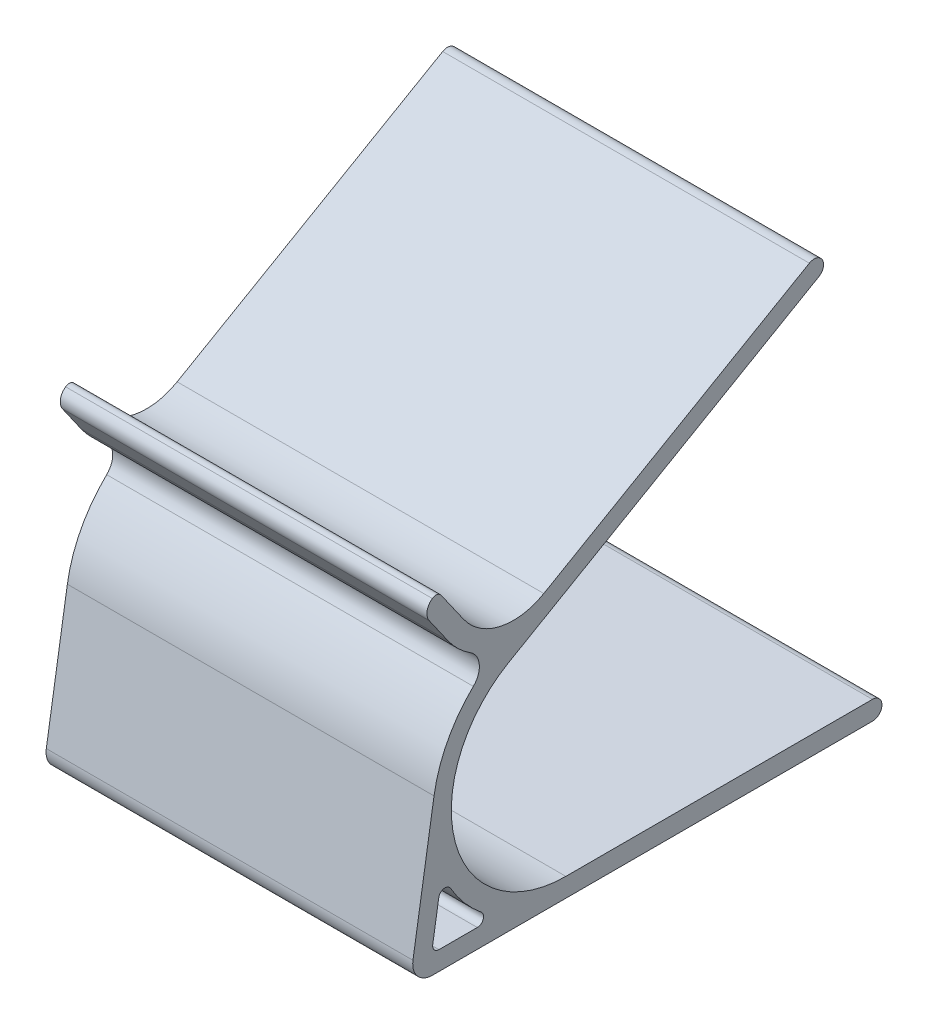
ISO-10303-21;
HEADER;
FILE_DESCRIPTION(('STEP AP214'),'2;1');
FILE_NAME('part.step','',(''),(''),'','','');
FILE_SCHEMA(('AUTOMOTIVE_DESIGN { 1 0 10303 214 1 1 1 1 }'));
ENDSEC;
DATA;
#1=APPLICATION_CONTEXT('core data for automotive mechanical design processes');
#2=APPLICATION_PROTOCOL_DEFINITION('international standard','automotive_design',2000,#1);
#3=PRODUCT_CONTEXT('',#1,'mechanical');
#4=PRODUCT('Part','Part','',(#3));
#5=PRODUCT_RELATED_PRODUCT_CATEGORY('part','',(#4));
#6=PRODUCT_DEFINITION_FORMATION('','',#4);
#7=PRODUCT_DEFINITION_CONTEXT('part definition',#1,'design');
#8=PRODUCT_DEFINITION('design','',#6,#7);
#9=PRODUCT_DEFINITION_SHAPE('','',#8);
#10=(LENGTH_UNIT() NAMED_UNIT(*) SI_UNIT(.MILLI.,.METRE.));
#11=(NAMED_UNIT(*) PLANE_ANGLE_UNIT() SI_UNIT($,.RADIAN.));
#12=(NAMED_UNIT(*) SI_UNIT($,.STERADIAN.) SOLID_ANGLE_UNIT());
#13=UNCERTAINTY_MEASURE_WITH_UNIT(LENGTH_MEASURE(1.E-05),#10,'distance_accuracy_value','');
#14=(GEOMETRIC_REPRESENTATION_CONTEXT(3) GLOBAL_UNCERTAINTY_ASSIGNED_CONTEXT((#13)) GLOBAL_UNIT_ASSIGNED_CONTEXT((#10,
#11,#12)) REPRESENTATION_CONTEXT('',''));
#15=CARTESIAN_POINT('',(0.,0.,0.));
#16=DIRECTION('',(0.,0.,1.));
#17=DIRECTION('',(1.,0.,0.));
#18=AXIS2_PLACEMENT_3D('',#15,#16,#17);
#19=CARTESIAN_POINT('',(58.,21.1173331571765,0.));
#20=DIRECTION('',(-1.,0.,0.));
#21=DIRECTION('',(0.,0.,1.));
#22=AXIS2_PLACEMENT_3D('',#19,#20,#21);
#23=PLANE('',#22);
#24=CARTESIAN_POINT('',(58.,1.5,-48.5));
#25=DIRECTION('',(-1.,0.,0.));
#26=DIRECTION('',(0.,0.,1.));
#27=AXIS2_PLACEMENT_3D('',#24,#25,#26);
#28=CIRCLE('',#27,1.5);
#29=CARTESIAN_POINT('',(58.,0.,-48.5));
#30=VERTEX_POINT('',#29);
#31=CARTESIAN_POINT('',(58.,1.5,-50.));
#32=VERTEX_POINT('',#31);
#33=EDGE_CURVE('E449',#30,#32,#28,.F.);
#34=ORIENTED_EDGE('',*,*,#33,.T.);
#35=CARTESIAN_POINT('',(58.,1.5,-48.5));
#36=DIRECTION('',(-1.,0.,0.));
#37=DIRECTION('',(0.,0.,1.));
#38=AXIS2_PLACEMENT_3D('',#35,#36,#37);
#39=CIRCLE('',#38,1.5);
#40=CARTESIAN_POINT('',(58.,3.,-48.5));
#41=VERTEX_POINT('',#40);
#42=EDGE_CURVE('E452',#32,#41,#39,.F.);
#43=ORIENTED_EDGE('',*,*,#42,.T.);
#44=DIRECTION('',(0.,0.,1.));
#45=VECTOR('',#44,1.);
#46=CARTESIAN_POINT('',(58.,3.,-50.));
#47=LINE('',#46,#45);
#48=CARTESIAN_POINT('',(58.,2.99999999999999,0.));
#49=VERTEX_POINT('',#48);
#50=EDGE_CURVE('E286',#41,#49,#47,.T.);
#51=ORIENTED_EDGE('',*,*,#50,.T.);
#52=CARTESIAN_POINT('',(58.,21.1173331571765,0.));
#53=DIRECTION('',(-1.,0.,0.));
#54=DIRECTION('',(0.,0.,1.));
#55=AXIS2_PLACEMENT_3D('',#52,#53,#54);
#56=CIRCLE('',#55,18.1173331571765);
#57=CARTESIAN_POINT('',(58.,36.8074039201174,9.05866657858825));
#58=VERTEX_POINT('',#57);
#59=EDGE_CURVE('E290',#49,#58,#56,.T.);
#60=ORIENTED_EDGE('',*,*,#59,.T.);
#61=DIRECTION('',(0.,0.500000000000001,-0.866025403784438));
#62=VECTOR('',#61,1.);
#63=CARTESIAN_POINT('',(58.,65.8917429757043,-41.3168863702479));
#64=LINE('',#63,#62);
#65=CARTESIAN_POINT('',(58.,65.1417429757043,-40.0178482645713));
#66=VERTEX_POINT('',#65);
#67=EDGE_CURVE('E293',#58,#66,#64,.T.);
#68=ORIENTED_EDGE('',*,*,#67,.T.);
#69=CARTESIAN_POINT('',(58.,66.4407810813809,-39.2678482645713));
#70=DIRECTION('',(-1.,0.,0.));
#71=DIRECTION('',(0.,0.,1.));
#72=AXIS2_PLACEMENT_3D('',#69,#70,#71);
#73=CIRCLE('',#72,1.5);
#74=CARTESIAN_POINT('',(58.,67.1907810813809,-40.5668863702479));
#75=VERTEX_POINT('',#74);
#76=EDGE_CURVE('E62',#66,#75,#73,.F.);
#77=ORIENTED_EDGE('',*,*,#76,.T.);
#78=CARTESIAN_POINT('',(58.,66.4407810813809,-39.2678482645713));
#79=DIRECTION('',(-1.,0.,0.));
#80=DIRECTION('',(0.,0.,1.));
#81=AXIS2_PLACEMENT_3D('',#78,#79,#80);
#82=CIRCLE('',#81,1.5);
#83=CARTESIAN_POINT('',(58.,67.7398191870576,-38.5178482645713));
#84=VERTEX_POINT('',#83);
#85=EDGE_CURVE('E57',#75,#84,#82,.F.);
#86=ORIENTED_EDGE('',*,*,#85,.T.);
#87=DIRECTION('',(0.,-0.5,0.866025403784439));
#88=VECTOR('',#87,1.);
#89=CARTESIAN_POINT('',(58.,68.4898191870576,-39.8168863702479));
#90=LINE('',#89,#88);
#91=CARTESIAN_POINT('',(58.,43.4898191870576,3.484383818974));
#92=VERTEX_POINT('',#91);
#93=EDGE_CURVE('E296',#84,#92,#90,.T.);
#94=ORIENTED_EDGE('',*,*,#93,.T.);
#95=CARTESIAN_POINT('',(58.,51.8220375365,8.29499232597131));
#96=DIRECTION('',(-1.,0.,0.));
#97=DIRECTION('',(0.,0.,1.));
#98=AXIS2_PLACEMENT_3D('',#95,#96,#97);
#99=CIRCLE('',#98,9.62121701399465);
#100=CARTESIAN_POINT('',(58.,46.303534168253,16.1762319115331));
#101=VERTEX_POINT('',#100);
#102=EDGE_CURVE('E299',#92,#101,#99,.T.);
#103=ORIENTED_EDGE('',*,*,#102,.T.);
#104=DIRECTION('',(0.,0.819152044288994,0.573576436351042));
#105=VECTOR('',#104,1.);
#106=CARTESIAN_POINT('',(58.,46.303534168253,16.1762319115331));
#107=LINE('',#106,#105);
#108=CARTESIAN_POINT('',(58.,51.3822768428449,19.7324058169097));
#109=VERTEX_POINT('',#108);
#110=EDGE_CURVE('E302',#101,#109,#107,.T.);
#111=ORIENTED_EDGE('',*,*,#110,.T.);
#112=CARTESIAN_POINT('',(58.,50.8087004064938,20.5515578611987));
#113=DIRECTION('',(-1.,0.,0.));
#114=DIRECTION('',(0.,0.,1.));
#115=AXIS2_PLACEMENT_3D('',#112,#113,#114);
#116=CIRCLE('',#115,1.);
#117=CARTESIAN_POINT('',(58.,51.6278524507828,21.1251342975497));
#118=VERTEX_POINT('',#117);
#119=EDGE_CURVE('E426',#109,#118,#116,.F.);
#120=ORIENTED_EDGE('',*,*,#119,.T.);
#121=CARTESIAN_POINT('',(58.,49.9895483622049,19.9779814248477));
#122=DIRECTION('',(-1.,0.,0.));
#123=DIRECTION('',(0.,0.,1.));
#124=AXIS2_PLACEMENT_3D('',#121,#122,#123);
#125=CIRCLE('',#124,2.);
#126=CARTESIAN_POINT('',(58.,48.8423954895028,21.6162855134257));
#127=VERTEX_POINT('',#126);
#128=EDGE_CURVE('E417',#118,#127,#125,.F.);
#129=ORIENTED_EDGE('',*,*,#128,.T.);
#130=DIRECTION('',(0.,-0.819152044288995,-0.573576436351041));
#131=VECTOR('',#130,1.);
#132=CARTESIAN_POINT('',(58.,50.4806995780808,22.7634383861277));
#133=LINE('',#132,#131);
#134=CARTESIAN_POINT('',(58.,44.5828048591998,18.6336880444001));
#135=VERTEX_POINT('',#134);
#136=EDGE_CURVE('E306',#127,#135,#133,.T.);
#137=ORIENTED_EDGE('',*,*,#136,.T.);
#138=CARTESIAN_POINT('',(58.,51.8220375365,8.29499232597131));
#139=DIRECTION('',(1.,0.,0.));
#140=DIRECTION('',(0.,0.,-1.));
#141=AXIS2_PLACEMENT_3D('',#138,#139,#140);
#142=CIRCLE('',#141,12.6212170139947);
#143=CARTESIAN_POINT('',(58.,41.1971133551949,15.1071949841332));
#144=VERTEX_POINT('',#143);
#145=EDGE_CURVE('E309',#135,#144,#142,.T.);
#146=ORIENTED_EDGE('',*,*,#145,.T.);
#147=CARTESIAN_POINT('',(58.,38.5831118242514,16.7831700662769));
#148=DIRECTION('',(-1.,0.,0.));
#149=DIRECTION('',(0.,0.,1.));
#150=AXIS2_PLACEMENT_3D('',#147,#148,#149);
#151=CIRCLE('',#150,3.10514033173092);
#152=CARTESIAN_POINT('',(58.,36.3441293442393,14.6316929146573));
#153=VERTEX_POINT('',#152);
#154=EDGE_CURVE('E312',#144,#153,#151,.T.);
#155=ORIENTED_EDGE('',*,*,#154,.T.);
#156=CARTESIAN_POINT('',(58.,21.1173331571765,0.));
#157=DIRECTION('',(1.,0.,0.));
#158=DIRECTION('',(0.,0.,1.));
#159=AXIS2_PLACEMENT_3D('',#156,#157,#158);
#160=CIRCLE('',#159,21.1173331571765);
#161=CARTESIAN_POINT('',(58.,24.4479096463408,20.8530338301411));
#162=VERTEX_POINT('',#161);
#163=EDGE_CURVE('E315',#153,#162,#160,.T.);
#164=ORIENTED_EDGE('',*,*,#163,.T.);
#165=DIRECTION('',(0.,-0.987484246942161,0.157717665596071));
#166=VECTOR('',#165,1.);
#167=CARTESIAN_POINT('',(58.,3.59487581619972,24.1836103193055));
#168=LINE('',#167,#166);
#169=CARTESIAN_POINT('',(58.,3.59487581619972,24.1836103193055));
#170=VERTEX_POINT('',#169);
#171=EDGE_CURVE('E318',#162,#170,#168,.T.);
#172=ORIENTED_EDGE('',*,*,#171,.T.);
#173=CARTESIAN_POINT('',(58.,3.10514033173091,21.1173331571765));
#174=DIRECTION('',(1.,0.,0.));
#175=DIRECTION('',(0.,0.,1.));
#176=AXIS2_PLACEMENT_3D('',#173,#174,#175);
#177=CIRCLE('',#176,3.10514033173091);
#178=CARTESIAN_POINT('',(58.,0.,21.1173331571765));
#179=VERTEX_POINT('',#178);
#180=EDGE_CURVE('E321',#170,#179,#177,.T.);
#181=ORIENTED_EDGE('',*,*,#180,.T.);
#182=DIRECTION('',(0.,0.,-1.));
#183=VECTOR('',#182,1.);
#184=CARTESIAN_POINT('',(58.,0.,21.1173331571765));
#185=LINE('',#184,#183);
#186=EDGE_CURVE('E282',#179,#30,#185,.T.);
#187=ORIENTED_EDGE('',*,*,#186,.T.);
#188=EDGE_LOOP('',(#34,#43,#51,#60,#68,#77,#86,#94,#103,#111,#120,#129,#137,#146,#155,#164,#172,
#181,#187));
#189=FACE_BOUND('',#188,.T.);
#190=CARTESIAN_POINT('',(58.,4.,20.068207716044));
#191=DIRECTION('',(1.,0.,0.));
#192=DIRECTION('',(0.,0.,-1.));
#193=AXIS2_PLACEMENT_3D('',#190,#191,#192);
#194=CIRCLE('',#193,1.);
#195=CARTESIAN_POINT('',(58.,4.15771766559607,21.0556919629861));
#196=VERTEX_POINT('',#195);
#197=CARTESIAN_POINT('',(58.,3.,20.068207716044));
#198=VERTEX_POINT('',#197);
#199=EDGE_CURVE('E207',#196,#198,#194,.T.);
#200=ORIENTED_EDGE('',*,*,#199,.F.);
#201=DIRECTION('',(0.,-0.987484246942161,0.15771766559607));
#202=VECTOR('',#201,1.);
#203=CARTESIAN_POINT('',(58.,10.1438656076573,20.0996045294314));
#204=LINE('',#203,#202);
#205=CARTESIAN_POINT('',(58.,10.1438656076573,20.0996045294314));
#206=VERTEX_POINT('',#205);
#207=EDGE_CURVE('E245',#206,#196,#204,.T.);
#208=ORIENTED_EDGE('',*,*,#207,.F.);
#209=CARTESIAN_POINT('',(58.,9.98614794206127,19.1121202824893));
#210=DIRECTION('',(1.,0.,0.));
#211=DIRECTION('',(0.,0.,1.));
#212=AXIS2_PLACEMENT_3D('',#209,#210,#211);
#213=CIRCLE('',#212,1.);
#214=CARTESIAN_POINT('',(58.,10.4894267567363,18.247996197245));
#215=VERTEX_POINT('',#214);
#216=EDGE_CURVE('E241',#215,#206,#213,.T.);
#217=ORIENTED_EDGE('',*,*,#216,.F.);
#218=CARTESIAN_POINT('',(58.,21.1173331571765,0.));
#219=DIRECTION('',(-1.,0.,0.));
#220=DIRECTION('',(0.,0.,-1.));
#221=AXIS2_PLACEMENT_3D('',#218,#219,#220);
#222=CIRCLE('',#221,21.1173331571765);
#223=CARTESIAN_POINT('',(58.,4.77393296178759,13.3729215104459));
#224=VERTEX_POINT('',#223);
#225=EDGE_CURVE('E236',#224,#215,#222,.T.);
#226=ORIENTED_EDGE('',*,*,#225,.F.);
#227=CARTESIAN_POINT('',(58.,4.,14.0061890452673));
#228=DIRECTION('',(1.,0.,0.));
#229=DIRECTION('',(0.,0.,1.));
#230=AXIS2_PLACEMENT_3D('',#227,#228,#229);
#231=CIRCLE('',#230,1.);
#232=CARTESIAN_POINT('',(58.,3.,14.0061890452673));
#233=VERTEX_POINT('',#232);
#234=EDGE_CURVE('E232',#233,#224,#231,.T.);
#235=ORIENTED_EDGE('',*,*,#234,.F.);
#236=DIRECTION('',(0.,0.,-1.));
#237=VECTOR('',#236,1.);
#238=CARTESIAN_POINT('',(58.,3.,20.068207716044));
#239=LINE('',#238,#237);
#240=EDGE_CURVE('E218',#198,#233,#239,.T.);
#241=ORIENTED_EDGE('',*,*,#240,.F.);
#242=EDGE_LOOP('',(#200,#208,#217,#226,#235,#241));
#243=FACE_BOUND('',#242,.T.);
#244=ADVANCED_FACE('F39',(#189,#243),#23,.F.);
#245=CARTESIAN_POINT('',(0.,21.1173331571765,0.));
#246=DIRECTION('',(-1.,0.,0.));
#247=DIRECTION('',(0.,0.,1.));
#248=AXIS2_PLACEMENT_3D('',#245,#246,#247);
#249=PLANE('',#248);
#250=DIRECTION('',(0.,0.,1.));
#251=VECTOR('',#250,1.);
#252=CARTESIAN_POINT('',(0.,3.,-50.));
#253=LINE('',#252,#251);
#254=CARTESIAN_POINT('',(0.,3.,-48.5));
#255=VERTEX_POINT('',#254);
#256=CARTESIAN_POINT('',(0.,2.99999999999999,0.));
#257=VERTEX_POINT('',#256);
#258=EDGE_CURVE('E328',#255,#257,#253,.T.);
#259=ORIENTED_EDGE('',*,*,#258,.F.);
#260=CARTESIAN_POINT('',(0.,1.5,-48.5));
#261=DIRECTION('',(-1.,0.,0.));
#262=DIRECTION('',(0.,0.,1.));
#263=AXIS2_PLACEMENT_3D('',#260,#261,#262);
#264=CIRCLE('',#263,1.5);
#265=CARTESIAN_POINT('',(0.,1.5,-50.));
#266=VERTEX_POINT('',#265);
#267=EDGE_CURVE('E442',#255,#266,#264,.T.);
#268=ORIENTED_EDGE('',*,*,#267,.T.);
#269=CARTESIAN_POINT('',(0.,1.5,-48.5));
#270=DIRECTION('',(-1.,0.,0.));
#271=DIRECTION('',(0.,0.,1.));
#272=AXIS2_PLACEMENT_3D('',#269,#270,#271);
#273=CIRCLE('',#272,1.5);
#274=CARTESIAN_POINT('',(0.,0.,-48.5));
#275=VERTEX_POINT('',#274);
#276=EDGE_CURVE('E439',#266,#275,#273,.T.);
#277=ORIENTED_EDGE('',*,*,#276,.T.);
#278=DIRECTION('',(0.,0.,-1.));
#279=VECTOR('',#278,1.);
#280=CARTESIAN_POINT('',(0.,0.,0.));
#281=LINE('',#280,#279);
#282=CARTESIAN_POINT('',(0.,0.,21.1173331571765));
#283=VERTEX_POINT('',#282);
#284=EDGE_CURVE('E227',#283,#275,#281,.T.);
#285=ORIENTED_EDGE('',*,*,#284,.F.);
#286=CARTESIAN_POINT('',(0.,3.10514033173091,21.1173331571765));
#287=DIRECTION('',(1.,0.,0.));
#288=DIRECTION('',(0.,0.,1.));
#289=AXIS2_PLACEMENT_3D('',#286,#287,#288);
#290=CIRCLE('',#289,3.10514033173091);
#291=CARTESIAN_POINT('',(0.,3.59487581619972,24.1836103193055));
#292=VERTEX_POINT('',#291);
#293=EDGE_CURVE('E287',#292,#283,#290,.T.);
#294=ORIENTED_EDGE('',*,*,#293,.F.);
#295=DIRECTION('',(0.,-0.987484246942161,0.157717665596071));
#296=VECTOR('',#295,1.);
#297=CARTESIAN_POINT('',(0.,3.59487581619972,24.1836103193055));
#298=LINE('',#297,#296);
#299=CARTESIAN_POINT('',(0.,24.4479096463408,20.8530338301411));
#300=VERTEX_POINT('',#299);
#301=EDGE_CURVE('E360',#300,#292,#298,.T.);
#302=ORIENTED_EDGE('',*,*,#301,.F.);
#303=CARTESIAN_POINT('',(0.,21.1173331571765,0.));
#304=DIRECTION('',(1.,0.,0.));
#305=DIRECTION('',(0.,0.,1.));
#306=AXIS2_PLACEMENT_3D('',#303,#304,#305);
#307=CIRCLE('',#306,21.1173331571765);
#308=CARTESIAN_POINT('',(0.,36.3441293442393,14.6316929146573));
#309=VERTEX_POINT('',#308);
#310=EDGE_CURVE('E357',#309,#300,#307,.T.);
#311=ORIENTED_EDGE('',*,*,#310,.F.);
#312=CARTESIAN_POINT('',(0.,38.5831118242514,16.7831700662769));
#313=DIRECTION('',(-1.,0.,0.));
#314=DIRECTION('',(0.,0.,1.));
#315=AXIS2_PLACEMENT_3D('',#312,#313,#314);
#316=CIRCLE('',#315,3.10514033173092);
#317=CARTESIAN_POINT('',(0.,41.1971133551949,15.1071949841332));
#318=VERTEX_POINT('',#317);
#319=EDGE_CURVE('E354',#318,#309,#316,.T.);
#320=ORIENTED_EDGE('',*,*,#319,.F.);
#321=CARTESIAN_POINT('',(0.,51.8220375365,8.29499232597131));
#322=DIRECTION('',(1.,0.,0.));
#323=DIRECTION('',(0.,0.,-1.));
#324=AXIS2_PLACEMENT_3D('',#321,#322,#323);
#325=CIRCLE('',#324,12.6212170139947);
#326=CARTESIAN_POINT('',(0.,44.5828048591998,18.6336880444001));
#327=VERTEX_POINT('',#326);
#328=EDGE_CURVE('E351',#327,#318,#325,.T.);
#329=ORIENTED_EDGE('',*,*,#328,.F.);
#330=DIRECTION('',(0.,-0.819152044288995,-0.573576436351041));
#331=VECTOR('',#330,1.);
#332=CARTESIAN_POINT('',(0.,50.4806995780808,22.7634383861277));
#333=LINE('',#332,#331);
#334=CARTESIAN_POINT('',(0.,48.8423954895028,21.6162855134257));
#335=VERTEX_POINT('',#334);
#336=EDGE_CURVE('E348',#335,#327,#333,.T.);
#337=ORIENTED_EDGE('',*,*,#336,.F.);
#338=CARTESIAN_POINT('',(0.,49.9895483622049,19.9779814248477));
#339=DIRECTION('',(-1.,0.,0.));
#340=DIRECTION('',(0.,0.,1.));
#341=AXIS2_PLACEMENT_3D('',#338,#339,#340);
#342=CIRCLE('',#341,2.);
#343=CARTESIAN_POINT('',(0.,51.6278524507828,21.1251342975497));
#344=VERTEX_POINT('',#343);
#345=EDGE_CURVE('E409',#335,#344,#342,.T.);
#346=ORIENTED_EDGE('',*,*,#345,.T.);
#347=CARTESIAN_POINT('',(0.,50.8087004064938,20.5515578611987));
#348=DIRECTION('',(-1.,0.,0.));
#349=DIRECTION('',(0.,0.,1.));
#350=AXIS2_PLACEMENT_3D('',#347,#348,#349);
#351=CIRCLE('',#350,1.);
#352=CARTESIAN_POINT('',(0.,51.3822768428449,19.7324058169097));
#353=VERTEX_POINT('',#352);
#354=EDGE_CURVE('E420',#344,#353,#351,.T.);
#355=ORIENTED_EDGE('',*,*,#354,.T.);
#356=DIRECTION('',(0.,0.819152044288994,0.573576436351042));
#357=VECTOR('',#356,1.);
#358=CARTESIAN_POINT('',(0.,46.303534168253,16.1762319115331));
#359=LINE('',#358,#357);
#360=CARTESIAN_POINT('',(0.,46.303534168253,16.1762319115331));
#361=VERTEX_POINT('',#360);
#362=EDGE_CURVE('E344',#361,#353,#359,.T.);
#363=ORIENTED_EDGE('',*,*,#362,.F.);
#364=CARTESIAN_POINT('',(0.,51.8220375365,8.29499232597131));
#365=DIRECTION('',(-1.,0.,0.));
#366=DIRECTION('',(0.,0.,1.));
#367=AXIS2_PLACEMENT_3D('',#364,#365,#366);
#368=CIRCLE('',#367,9.62121701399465);
#369=CARTESIAN_POINT('',(0.,43.4898191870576,3.484383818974));
#370=VERTEX_POINT('',#369);
#371=EDGE_CURVE('E341',#370,#361,#368,.T.);
#372=ORIENTED_EDGE('',*,*,#371,.F.);
#373=DIRECTION('',(0.,-0.5,0.866025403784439));
#374=VECTOR('',#373,1.);
#375=CARTESIAN_POINT('',(0.,68.4898191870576,-39.8168863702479));
#376=LINE('',#375,#374);
#377=CARTESIAN_POINT('',(0.,67.7398191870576,-38.5178482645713));
#378=VERTEX_POINT('',#377);
#379=EDGE_CURVE('E338',#378,#370,#376,.T.);
#380=ORIENTED_EDGE('',*,*,#379,.F.);
#381=CARTESIAN_POINT('',(0.,66.4407810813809,-39.2678482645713));
#382=DIRECTION('',(-1.,0.,0.));
#383=DIRECTION('',(0.,0.,1.));
#384=AXIS2_PLACEMENT_3D('',#381,#382,#383);
#385=CIRCLE('',#384,1.5);
#386=CARTESIAN_POINT('',(0.,67.1907810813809,-40.5668863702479));
#387=VERTEX_POINT('',#386);
#388=EDGE_CURVE('E433',#378,#387,#385,.T.);
#389=ORIENTED_EDGE('',*,*,#388,.T.);
#390=CARTESIAN_POINT('',(0.,66.4407810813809,-39.2678482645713));
#391=DIRECTION('',(-1.,0.,0.));
#392=DIRECTION('',(0.,0.,1.));
#393=AXIS2_PLACEMENT_3D('',#390,#391,#392);
#394=CIRCLE('',#393,1.5);
#395=CARTESIAN_POINT('',(0.,65.1417429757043,-40.0178482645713));
#396=VERTEX_POINT('',#395);
#397=EDGE_CURVE('E436',#387,#396,#394,.T.);
#398=ORIENTED_EDGE('',*,*,#397,.T.);
#399=DIRECTION('',(0.,0.500000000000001,-0.866025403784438));
#400=VECTOR('',#399,1.);
#401=CARTESIAN_POINT('',(0.,65.8917429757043,-41.3168863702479));
#402=LINE('',#401,#400);
#403=CARTESIAN_POINT('',(0.,36.8074039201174,9.05866657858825));
#404=VERTEX_POINT('',#403);
#405=EDGE_CURVE('E334',#404,#396,#402,.T.);
#406=ORIENTED_EDGE('',*,*,#405,.F.);
#407=CARTESIAN_POINT('',(0.,21.1173331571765,0.));
#408=DIRECTION('',(-1.,0.,0.));
#409=DIRECTION('',(0.,0.,1.));
#410=AXIS2_PLACEMENT_3D('',#407,#408,#409);
#411=CIRCLE('',#410,18.1173331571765);
#412=EDGE_CURVE('E331',#257,#404,#411,.T.);
#413=ORIENTED_EDGE('',*,*,#412,.F.);
#414=EDGE_LOOP('',(#259,#268,#277,#285,#294,#302,#311,#320,#329,#337,#346,#355,#363,#372,#380,
#389,#398,#406,#413));
#415=FACE_BOUND('',#414,.T.);
#416=DIRECTION('',(0.,-0.987484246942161,0.15771766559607));
#417=VECTOR('',#416,1.);
#418=CARTESIAN_POINT('',(0.,10.1438656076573,20.0996045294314));
#419=LINE('',#418,#417);
#420=CARTESIAN_POINT('',(0.,10.1438656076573,20.0996045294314));
#421=VERTEX_POINT('',#420);
#422=CARTESIAN_POINT('',(0.,4.15771766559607,21.0556919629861));
#423=VERTEX_POINT('',#422);
#424=EDGE_CURVE('E219',#421,#423,#419,.T.);
#425=ORIENTED_EDGE('',*,*,#424,.T.);
#426=CARTESIAN_POINT('',(0.,4.,20.068207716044));
#427=DIRECTION('',(1.,0.,0.));
#428=DIRECTION('',(0.,0.,-1.));
#429=AXIS2_PLACEMENT_3D('',#426,#427,#428);
#430=CIRCLE('',#429,1.);
#431=CARTESIAN_POINT('',(0.,3.,20.068207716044));
#432=VERTEX_POINT('',#431);
#433=EDGE_CURVE('E248',#423,#432,#430,.T.);
#434=ORIENTED_EDGE('',*,*,#433,.T.);
#435=DIRECTION('',(0.,0.,-1.));
#436=VECTOR('',#435,1.);
#437=CARTESIAN_POINT('',(0.,3.,20.068207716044));
#438=LINE('',#437,#436);
#439=CARTESIAN_POINT('',(0.,3.,14.0061890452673));
#440=VERTEX_POINT('',#439);
#441=EDGE_CURVE('E225',#432,#440,#438,.T.);
#442=ORIENTED_EDGE('',*,*,#441,.T.);
#443=CARTESIAN_POINT('',(0.,4.,14.0061890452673));
#444=DIRECTION('',(1.,0.,0.));
#445=DIRECTION('',(0.,0.,1.));
#446=AXIS2_PLACEMENT_3D('',#443,#444,#445);
#447=CIRCLE('',#446,1.);
#448=CARTESIAN_POINT('',(0.,4.77393296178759,13.3729215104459));
#449=VERTEX_POINT('',#448);
#450=EDGE_CURVE('E254',#440,#449,#447,.T.);
#451=ORIENTED_EDGE('',*,*,#450,.T.);
#452=CARTESIAN_POINT('',(0.,21.1173331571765,0.));
#453=DIRECTION('',(-1.,0.,0.));
#454=DIRECTION('',(0.,0.,-1.));
#455=AXIS2_PLACEMENT_3D('',#452,#453,#454);
#456=CIRCLE('',#455,21.1173331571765);
#457=CARTESIAN_POINT('',(0.,10.4894267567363,18.247996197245));
#458=VERTEX_POINT('',#457);
#459=EDGE_CURVE('E258',#449,#458,#456,.T.);
#460=ORIENTED_EDGE('',*,*,#459,.T.);
#461=CARTESIAN_POINT('',(0.,9.98614794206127,19.1121202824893));
#462=DIRECTION('',(1.,0.,0.));
#463=DIRECTION('',(0.,0.,1.));
#464=AXIS2_PLACEMENT_3D('',#461,#462,#463);
#465=CIRCLE('',#464,1.);
#466=EDGE_CURVE('E262',#458,#421,#465,.T.);
#467=ORIENTED_EDGE('',*,*,#466,.T.);
#468=EDGE_LOOP('',(#425,#434,#442,#451,#460,#467));
#469=FACE_BOUND('',#468,.T.);
#470=ADVANCED_FACE('F482',(#415,#469),#249,.T.);
#471=CARTESIAN_POINT('',(58.,0.,0.));
#472=DIRECTION('',(0.,1.,0.));
#473=DIRECTION('',(0.,0.,1.));
#474=AXIS2_PLACEMENT_3D('',#471,#472,#473);
#475=PLANE('',#474);
#476=ORIENTED_EDGE('',*,*,#284,.T.);
#477=DIRECTION('',(-1.,0.,0.));
#478=VECTOR('',#477,1.);
#479=CARTESIAN_POINT('',(58.,0.,-48.5));
#480=LINE('',#479,#478);
#481=EDGE_CURVE('E455',#275,#30,#480,.F.);
#482=ORIENTED_EDGE('',*,*,#481,.T.);
#483=ORIENTED_EDGE('',*,*,#186,.F.);
#484=DIRECTION('',(-1.,0.,0.));
#485=VECTOR('',#484,1.);
#486=CARTESIAN_POINT('',(58.,0.,21.1173331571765));
#487=LINE('',#486,#485);
#488=EDGE_CURVE('E324',#179,#283,#487,.T.);
#489=ORIENTED_EDGE('',*,*,#488,.T.);
#490=EDGE_LOOP('',(#476,#482,#483,#489));
#491=FACE_BOUND('',#490,.T.);
#492=ADVANCED_FACE('F534',(#491),#475,.F.);
#493=CARTESIAN_POINT('',(58.,3.,-50.));
#494=DIRECTION('',(0.,-1.,0.));
#495=DIRECTION('',(0.,0.,-1.));
#496=AXIS2_PLACEMENT_3D('',#493,#494,#495);
#497=PLANE('',#496);
#498=ORIENTED_EDGE('',*,*,#50,.F.);
#499=DIRECTION('',(-1.,0.,0.));
#500=VECTOR('',#499,1.);
#501=CARTESIAN_POINT('',(58.,3.,-48.5));
#502=LINE('',#501,#500);
#503=EDGE_CURVE('E429',#41,#255,#502,.T.);
#504=ORIENTED_EDGE('',*,*,#503,.T.);
#505=ORIENTED_EDGE('',*,*,#258,.T.);
#506=DIRECTION('',(-1.,0.,0.));
#507=VECTOR('',#506,1.);
#508=CARTESIAN_POINT('',(58.,2.99999999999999,0.));
#509=LINE('',#508,#507);
#510=EDGE_CURVE('E401',#49,#257,#509,.T.);
#511=ORIENTED_EDGE('',*,*,#510,.F.);
#512=EDGE_LOOP('',(#498,#504,#505,#511));
#513=FACE_BOUND('',#512,.T.);
#514=ADVANCED_FACE('F543',(#513),#497,.F.);
#515=CARTESIAN_POINT('',(58.,21.1173331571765,0.));
#516=DIRECTION('',(-1.,0.,0.));
#517=DIRECTION('',(0.,0.,1.));
#518=AXIS2_PLACEMENT_3D('',#515,#516,#517);
#519=CYLINDRICAL_SURFACE('',#518,18.1173331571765);
#520=ORIENTED_EDGE('',*,*,#412,.T.);
#521=DIRECTION('',(-1.,0.,0.));
#522=VECTOR('',#521,1.);
#523=CARTESIAN_POINT('',(58.,36.8074039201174,9.05866657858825));
#524=LINE('',#523,#522);
#525=EDGE_CURVE('E397',#58,#404,#524,.T.);
#526=ORIENTED_EDGE('',*,*,#525,.F.);
#527=ORIENTED_EDGE('',*,*,#59,.F.);
#528=ORIENTED_EDGE('',*,*,#510,.T.);
#529=EDGE_LOOP('',(#520,#526,#527,#528));
#530=FACE_BOUND('',#529,.T.);
#531=ADVANCED_FACE('F549',(#530),#519,.F.);
#532=CARTESIAN_POINT('',(58.,65.8917429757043,-41.3168863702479));
#533=DIRECTION('',(0.,0.866025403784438,0.500000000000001));
#534=DIRECTION('',(0.,-0.500000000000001,0.866025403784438));
#535=AXIS2_PLACEMENT_3D('',#532,#533,#534);
#536=PLANE('',#535);
#537=ORIENTED_EDGE('',*,*,#405,.T.);
#538=DIRECTION('',(-1.,0.,0.));
#539=VECTOR('',#538,1.);
#540=CARTESIAN_POINT('',(58.,65.1417429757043,-40.0178482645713));
#541=LINE('',#540,#539);
#542=EDGE_CURVE('E49',#396,#66,#541,.F.);
#543=ORIENTED_EDGE('',*,*,#542,.T.);
#544=ORIENTED_EDGE('',*,*,#67,.F.);
#545=ORIENTED_EDGE('',*,*,#525,.T.);
#546=EDGE_LOOP('',(#537,#543,#544,#545));
#547=FACE_BOUND('',#546,.T.);
#548=ADVANCED_FACE('F553',(#547),#536,.F.);
#549=CARTESIAN_POINT('',(58.,68.4898191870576,-39.8168863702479));
#550=DIRECTION('',(0.,-0.866025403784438,-0.5));
#551=DIRECTION('',(0.,0.5,-0.866025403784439));
#552=AXIS2_PLACEMENT_3D('',#549,#550,#551);
#553=PLANE('',#552);
#554=ORIENTED_EDGE('',*,*,#93,.F.);
#555=DIRECTION('',(-1.,0.,0.));
#556=VECTOR('',#555,1.);
#557=CARTESIAN_POINT('',(58.,67.7398191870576,-38.5178482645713));
#558=LINE('',#557,#556);
#559=EDGE_CURVE('E11',#84,#378,#558,.T.);
#560=ORIENTED_EDGE('',*,*,#559,.T.);
#561=ORIENTED_EDGE('',*,*,#379,.T.);
#562=DIRECTION('',(-1.,0.,0.));
#563=VECTOR('',#562,1.);
#564=CARTESIAN_POINT('',(58.,43.4898191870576,3.484383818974));
#565=LINE('',#564,#563);
#566=EDGE_CURVE('E393',#92,#370,#565,.T.);
#567=ORIENTED_EDGE('',*,*,#566,.F.);
#568=EDGE_LOOP('',(#554,#560,#561,#567));
#569=FACE_BOUND('',#568,.T.);
#570=ADVANCED_FACE('F477',(#569),#553,.F.);
#571=CARTESIAN_POINT('',(58.,51.8220375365,8.29499232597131));
#572=DIRECTION('',(-1.,0.,0.));
#573=DIRECTION('',(0.,0.,1.));
#574=AXIS2_PLACEMENT_3D('',#571,#572,#573);
#575=CYLINDRICAL_SURFACE('',#574,9.62121701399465);
#576=ORIENTED_EDGE('',*,*,#371,.T.);
#577=DIRECTION('',(-1.,0.,0.));
#578=VECTOR('',#577,1.);
#579=CARTESIAN_POINT('',(58.,46.303534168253,16.1762319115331));
#580=LINE('',#579,#578);
#581=EDGE_CURVE('E389',#101,#361,#580,.T.);
#582=ORIENTED_EDGE('',*,*,#581,.F.);
#583=ORIENTED_EDGE('',*,*,#102,.F.);
#584=ORIENTED_EDGE('',*,*,#566,.T.);
#585=EDGE_LOOP('',(#576,#582,#583,#584));
#586=FACE_BOUND('',#585,.T.);
#587=ADVANCED_FACE('F487',(#586),#575,.F.);
#588=CARTESIAN_POINT('',(58.,46.303534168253,16.1762319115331));
#589=DIRECTION('',(0.,-0.573576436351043,0.819152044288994));
#590=DIRECTION('',(0.,-0.819152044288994,-0.573576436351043));
#591=AXIS2_PLACEMENT_3D('',#588,#589,#590);
#592=PLANE('',#591);
#593=ORIENTED_EDGE('',*,*,#362,.T.);
#594=DIRECTION('',(-1.,0.,0.));
#595=VECTOR('',#594,1.);
#596=CARTESIAN_POINT('',(58.,51.3822768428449,19.7324058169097));
#597=LINE('',#596,#595);
#598=EDGE_CURVE('E423',#353,#109,#597,.F.);
#599=ORIENTED_EDGE('',*,*,#598,.T.);
#600=ORIENTED_EDGE('',*,*,#110,.F.);
#601=ORIENTED_EDGE('',*,*,#581,.T.);
#602=EDGE_LOOP('',(#593,#599,#600,#601));
#603=FACE_BOUND('',#602,.T.);
#604=ADVANCED_FACE('F491',(#603),#592,.F.);
#605=CARTESIAN_POINT('',(58.,50.4806995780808,22.7634383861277));
#606=DIRECTION('',(0.,0.573576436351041,-0.819152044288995));
#607=DIRECTION('',(0.,0.819152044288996,0.573576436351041));
#608=AXIS2_PLACEMENT_3D('',#605,#606,#607);
#609=PLANE('',#608);
#610=ORIENTED_EDGE('',*,*,#136,.F.);
#611=DIRECTION('',(-1.,0.,0.));
#612=VECTOR('',#611,1.);
#613=CARTESIAN_POINT('',(58.,48.8423954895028,21.6162855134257));
#614=LINE('',#613,#612);
#615=EDGE_CURVE('E405',#127,#335,#614,.T.);
#616=ORIENTED_EDGE('',*,*,#615,.T.);
#617=ORIENTED_EDGE('',*,*,#336,.T.);
#618=DIRECTION('',(-1.,0.,0.));
#619=VECTOR('',#618,1.);
#620=CARTESIAN_POINT('',(58.,44.5828048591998,18.6336880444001));
#621=LINE('',#620,#619);
#622=EDGE_CURVE('E385',#135,#327,#621,.T.);
#623=ORIENTED_EDGE('',*,*,#622,.F.);
#624=EDGE_LOOP('',(#610,#616,#617,#623));
#625=FACE_BOUND('',#624,.T.);
#626=ADVANCED_FACE('F504',(#625),#609,.F.);
#627=CARTESIAN_POINT('',(58.,51.8220375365,8.29499232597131));
#628=DIRECTION('',(-1.,0.,0.));
#629=DIRECTION('',(0.,0.,1.));
#630=AXIS2_PLACEMENT_3D('',#627,#628,#629);
#631=CYLINDRICAL_SURFACE('',#630,12.6212170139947);
#632=ORIENTED_EDGE('',*,*,#328,.T.);
#633=DIRECTION('',(-1.,0.,0.));
#634=VECTOR('',#633,1.);
#635=CARTESIAN_POINT('',(58.,41.1971133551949,15.1071949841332));
#636=LINE('',#635,#634);
#637=EDGE_CURVE('E381',#144,#318,#636,.T.);
#638=ORIENTED_EDGE('',*,*,#637,.F.);
#639=ORIENTED_EDGE('',*,*,#145,.F.);
#640=ORIENTED_EDGE('',*,*,#622,.T.);
#641=EDGE_LOOP('',(#632,#638,#639,#640));
#642=FACE_BOUND('',#641,.T.);
#643=ADVANCED_FACE('F510',(#642),#631,.T.);
#644=CARTESIAN_POINT('',(58.,38.5831118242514,16.7831700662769));
#645=DIRECTION('',(-1.,0.,0.));
#646=DIRECTION('',(0.,0.,1.));
#647=AXIS2_PLACEMENT_3D('',#644,#645,#646);
#648=CYLINDRICAL_SURFACE('',#647,3.10514033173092);
#649=ORIENTED_EDGE('',*,*,#319,.T.);
#650=DIRECTION('',(-1.,0.,0.));
#651=VECTOR('',#650,1.);
#652=CARTESIAN_POINT('',(58.,36.3441293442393,14.6316929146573));
#653=LINE('',#652,#651);
#654=EDGE_CURVE('E377',#153,#309,#653,.T.);
#655=ORIENTED_EDGE('',*,*,#654,.F.);
#656=ORIENTED_EDGE('',*,*,#154,.F.);
#657=ORIENTED_EDGE('',*,*,#637,.T.);
#658=EDGE_LOOP('',(#649,#655,#656,#657));
#659=FACE_BOUND('',#658,.T.);
#660=ADVANCED_FACE('F516',(#659),#648,.F.);
#661=CARTESIAN_POINT('',(58.,21.1173331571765,0.));
#662=DIRECTION('',(-1.,0.,0.));
#663=DIRECTION('',(0.,0.,1.));
#664=AXIS2_PLACEMENT_3D('',#661,#662,#663);
#665=CYLINDRICAL_SURFACE('',#664,21.1173331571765);
#666=ORIENTED_EDGE('',*,*,#310,.T.);
#667=DIRECTION('',(-1.,0.,0.));
#668=VECTOR('',#667,1.);
#669=CARTESIAN_POINT('',(58.,24.4479096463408,20.8530338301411));
#670=LINE('',#669,#668);
#671=EDGE_CURVE('E373',#162,#300,#670,.T.);
#672=ORIENTED_EDGE('',*,*,#671,.F.);
#673=ORIENTED_EDGE('',*,*,#163,.F.);
#674=ORIENTED_EDGE('',*,*,#654,.T.);
#675=EDGE_LOOP('',(#666,#672,#673,#674));
#676=FACE_BOUND('',#675,.T.);
#677=ADVANCED_FACE('F520',(#676),#665,.T.);
#678=CARTESIAN_POINT('',(58.,3.59487581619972,24.1836103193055));
#679=DIRECTION('',(0.,-0.157717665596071,-0.987484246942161));
#680=DIRECTION('',(0.,0.987484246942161,-0.157717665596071));
#681=AXIS2_PLACEMENT_3D('',#678,#679,#680);
#682=PLANE('',#681);
#683=ORIENTED_EDGE('',*,*,#301,.T.);
#684=DIRECTION('',(-1.,0.,0.));
#685=VECTOR('',#684,1.);
#686=CARTESIAN_POINT('',(58.,3.59487581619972,24.1836103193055));
#687=LINE('',#686,#685);
#688=EDGE_CURVE('E369',#170,#292,#687,.T.);
#689=ORIENTED_EDGE('',*,*,#688,.F.);
#690=ORIENTED_EDGE('',*,*,#171,.F.);
#691=ORIENTED_EDGE('',*,*,#671,.T.);
#692=EDGE_LOOP('',(#683,#689,#690,#691));
#693=FACE_BOUND('',#692,.T.);
#694=ADVANCED_FACE('F525',(#693),#682,.F.);
#695=CARTESIAN_POINT('',(58.,3.10514033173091,21.1173331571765));
#696=DIRECTION('',(-1.,0.,0.));
#697=DIRECTION('',(0.,0.,1.));
#698=AXIS2_PLACEMENT_3D('',#695,#696,#697);
#699=CYLINDRICAL_SURFACE('',#698,3.10514033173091);
#700=ORIENTED_EDGE('',*,*,#293,.T.);
#701=ORIENTED_EDGE('',*,*,#488,.F.);
#702=ORIENTED_EDGE('',*,*,#180,.F.);
#703=ORIENTED_EDGE('',*,*,#688,.T.);
#704=EDGE_LOOP('',(#700,#701,#702,#703));
#705=FACE_BOUND('',#704,.T.);
#706=ADVANCED_FACE('F531',(#705),#699,.T.);
#707=CARTESIAN_POINT('',(58.,4.,20.068207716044));
#708=DIRECTION('',(-1.,0.,0.));
#709=DIRECTION('',(0.,0.,1.));
#710=AXIS2_PLACEMENT_3D('',#707,#708,#709);
#711=CYLINDRICAL_SURFACE('',#710,1.);
#712=ORIENTED_EDGE('',*,*,#433,.F.);
#713=DIRECTION('',(-1.,0.,0.));
#714=VECTOR('',#713,1.);
#715=CARTESIAN_POINT('',(58.,4.15771766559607,21.0556919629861));
#716=LINE('',#715,#714);
#717=EDGE_CURVE('E213',#196,#423,#716,.T.);
#718=ORIENTED_EDGE('',*,*,#717,.F.);
#719=ORIENTED_EDGE('',*,*,#199,.T.);
#720=DIRECTION('',(-1.,0.,0.));
#721=VECTOR('',#720,1.);
#722=CARTESIAN_POINT('',(58.,3.,20.068207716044));
#723=LINE('',#722,#721);
#724=EDGE_CURVE('E210',#198,#432,#723,.T.);
#725=ORIENTED_EDGE('',*,*,#724,.T.);
#726=EDGE_LOOP('',(#712,#718,#719,#725));
#727=FACE_BOUND('',#726,.T.);
#728=ADVANCED_FACE('F209',(#727),#711,.F.);
#729=CARTESIAN_POINT('',(58.,3.,20.068207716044));
#730=DIRECTION('',(0.,1.,0.));
#731=DIRECTION('',(0.,0.,1.));
#732=AXIS2_PLACEMENT_3D('',#729,#730,#731);
#733=PLANE('',#732);
#734=ORIENTED_EDGE('',*,*,#441,.F.);
#735=ORIENTED_EDGE('',*,*,#724,.F.);
#736=ORIENTED_EDGE('',*,*,#240,.T.);
#737=DIRECTION('',(-1.,0.,0.));
#738=VECTOR('',#737,1.);
#739=CARTESIAN_POINT('',(58.,3.,14.0061890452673));
#740=LINE('',#739,#738);
#741=EDGE_CURVE('E228',#233,#440,#740,.T.);
#742=ORIENTED_EDGE('',*,*,#741,.T.);
#743=EDGE_LOOP('',(#734,#735,#736,#742));
#744=FACE_BOUND('',#743,.T.);
#745=ADVANCED_FACE('F222',(#744),#733,.T.);
#746=CARTESIAN_POINT('',(58.,4.,14.0061890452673));
#747=DIRECTION('',(-1.,0.,0.));
#748=DIRECTION('',(0.,0.,1.));
#749=AXIS2_PLACEMENT_3D('',#746,#747,#748);
#750=CYLINDRICAL_SURFACE('',#749,1.);
#751=ORIENTED_EDGE('',*,*,#450,.F.);
#752=ORIENTED_EDGE('',*,*,#741,.F.);
#753=ORIENTED_EDGE('',*,*,#234,.T.);
#754=DIRECTION('',(-1.,0.,0.));
#755=VECTOR('',#754,1.);
#756=CARTESIAN_POINT('',(58.,4.77393296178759,13.3729215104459));
#757=LINE('',#756,#755);
#758=EDGE_CURVE('E277',#224,#449,#757,.T.);
#759=ORIENTED_EDGE('',*,*,#758,.T.);
#760=EDGE_LOOP('',(#751,#752,#753,#759));
#761=FACE_BOUND('',#760,.T.);
#762=ADVANCED_FACE('F632',(#761),#750,.F.);
#763=CARTESIAN_POINT('',(58.,21.1173331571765,0.));
#764=DIRECTION('',(-1.,0.,0.));
#765=DIRECTION('',(0.,0.,1.));
#766=AXIS2_PLACEMENT_3D('',#763,#764,#765);
#767=CYLINDRICAL_SURFACE('',#766,21.1173331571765);
#768=ORIENTED_EDGE('',*,*,#459,.F.);
#769=ORIENTED_EDGE('',*,*,#758,.F.);
#770=ORIENTED_EDGE('',*,*,#225,.T.);
#771=DIRECTION('',(-1.,0.,0.));
#772=VECTOR('',#771,1.);
#773=CARTESIAN_POINT('',(58.,10.4894267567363,18.247996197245));
#774=LINE('',#773,#772);
#775=EDGE_CURVE('E274',#215,#458,#774,.T.);
#776=ORIENTED_EDGE('',*,*,#775,.T.);
#777=EDGE_LOOP('',(#768,#769,#770,#776));
#778=FACE_BOUND('',#777,.T.);
#779=ADVANCED_FACE('F638',(#778),#767,.T.);
#780=CARTESIAN_POINT('',(58.,9.98614794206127,19.1121202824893));
#781=DIRECTION('',(-1.,0.,0.));
#782=DIRECTION('',(0.,0.,1.));
#783=AXIS2_PLACEMENT_3D('',#780,#781,#782);
#784=CYLINDRICAL_SURFACE('',#783,1.);
#785=ORIENTED_EDGE('',*,*,#466,.F.);
#786=ORIENTED_EDGE('',*,*,#775,.F.);
#787=ORIENTED_EDGE('',*,*,#216,.T.);
#788=DIRECTION('',(-1.,0.,0.));
#789=VECTOR('',#788,1.);
#790=CARTESIAN_POINT('',(58.,10.1438656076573,20.0996045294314));
#791=LINE('',#790,#789);
#792=EDGE_CURVE('E271',#206,#421,#791,.T.);
#793=ORIENTED_EDGE('',*,*,#792,.T.);
#794=EDGE_LOOP('',(#785,#786,#787,#793));
#795=FACE_BOUND('',#794,.T.);
#796=ADVANCED_FACE('F646',(#795),#784,.F.);
#797=CARTESIAN_POINT('',(58.,10.1438656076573,20.0996045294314));
#798=DIRECTION('',(0.,-0.15771766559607,-0.987484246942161));
#799=DIRECTION('',(0.,0.987484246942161,-0.15771766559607));
#800=AXIS2_PLACEMENT_3D('',#797,#798,#799);
#801=PLANE('',#800);
#802=ORIENTED_EDGE('',*,*,#424,.F.);
#803=ORIENTED_EDGE('',*,*,#792,.F.);
#804=ORIENTED_EDGE('',*,*,#207,.T.);
#805=ORIENTED_EDGE('',*,*,#717,.T.);
#806=EDGE_LOOP('',(#802,#803,#804,#805));
#807=FACE_BOUND('',#806,.T.);
#808=ADVANCED_FACE('F654',(#807),#801,.T.);
#809=CARTESIAN_POINT('',(58.,49.9895483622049,19.9779814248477));
#810=DIRECTION('',(-1.,0.,0.));
#811=DIRECTION('',(0.,0.,1.));
#812=AXIS2_PLACEMENT_3D('',#809,#810,#811);
#813=CYLINDRICAL_SURFACE('',#812,2.);
#814=ORIENTED_EDGE('',*,*,#128,.F.);
#815=DIRECTION('',(-1.,0.,0.));
#816=VECTOR('',#815,1.);
#817=CARTESIAN_POINT('',(58.,51.6278524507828,21.1251342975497));
#818=LINE('',#817,#816);
#819=EDGE_CURVE('E413',#344,#118,#818,.F.);
#820=ORIENTED_EDGE('',*,*,#819,.F.);
#821=ORIENTED_EDGE('',*,*,#345,.F.);
#822=ORIENTED_EDGE('',*,*,#615,.F.);
#823=EDGE_LOOP('',(#814,#820,#821,#822));
#824=FACE_BOUND('',#823,.T.);
#825=ADVANCED_FACE('F499',(#824),#813,.T.);
#826=CARTESIAN_POINT('',(58.,50.8087004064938,20.5515578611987));
#827=DIRECTION('',(-1.,0.,0.));
#828=DIRECTION('',(0.,0.,1.));
#829=AXIS2_PLACEMENT_3D('',#826,#827,#828);
#830=CYLINDRICAL_SURFACE('',#829,1.);
#831=ORIENTED_EDGE('',*,*,#119,.F.);
#832=ORIENTED_EDGE('',*,*,#598,.F.);
#833=ORIENTED_EDGE('',*,*,#354,.F.);
#834=ORIENTED_EDGE('',*,*,#819,.T.);
#835=EDGE_LOOP('',(#831,#832,#833,#834));
#836=FACE_BOUND('',#835,.T.);
#837=ADVANCED_FACE('F496',(#836),#830,.T.);
#838=CARTESIAN_POINT('',(58.,1.5,-48.5));
#839=DIRECTION('',(-1.,0.,0.));
#840=DIRECTION('',(0.,0.,1.));
#841=AXIS2_PLACEMENT_3D('',#838,#839,#840);
#842=CYLINDRICAL_SURFACE('',#841,1.5);
#843=DIRECTION('',(-1.,0.,0.));
#844=VECTOR('',#843,1.);
#845=CARTESIAN_POINT('',(58.,1.5,-50.));
#846=LINE('',#845,#844);
#847=EDGE_CURVE('E251',#32,#266,#846,.T.);
#848=ORIENTED_EDGE('',*,*,#847,.F.);
#849=ORIENTED_EDGE('',*,*,#33,.F.);
#850=ORIENTED_EDGE('',*,*,#481,.F.);
#851=ORIENTED_EDGE('',*,*,#276,.F.);
#852=EDGE_LOOP('',(#848,#849,#850,#851));
#853=FACE_BOUND('',#852,.T.);
#854=ADVANCED_FACE('F538',(#853),#842,.T.);
#855=CARTESIAN_POINT('',(58.,1.5,-48.5));
#856=DIRECTION('',(-1.,0.,0.));
#857=DIRECTION('',(0.,0.,1.));
#858=AXIS2_PLACEMENT_3D('',#855,#856,#857);
#859=CYLINDRICAL_SURFACE('',#858,1.5);
#860=ORIENTED_EDGE('',*,*,#42,.F.);
#861=ORIENTED_EDGE('',*,*,#847,.T.);
#862=ORIENTED_EDGE('',*,*,#267,.F.);
#863=ORIENTED_EDGE('',*,*,#503,.F.);
#864=EDGE_LOOP('',(#860,#861,#862,#863));
#865=FACE_BOUND('',#864,.T.);
#866=ADVANCED_FACE('F545',(#865),#859,.T.);
#867=CARTESIAN_POINT('',(58.,66.4407810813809,-39.2678482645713));
#868=DIRECTION('',(-1.,0.,0.));
#869=DIRECTION('',(0.,0.,1.));
#870=AXIS2_PLACEMENT_3D('',#867,#868,#869);
#871=CYLINDRICAL_SURFACE('',#870,1.5);
#872=ORIENTED_EDGE('',*,*,#559,.F.);
#873=ORIENTED_EDGE('',*,*,#85,.F.);
#874=DIRECTION('',(-1.,0.,0.));
#875=VECTOR('',#874,1.);
#876=CARTESIAN_POINT('',(58.,67.1907810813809,-40.5668863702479));
#877=LINE('',#876,#875);
#878=EDGE_CURVE('E43',#387,#75,#877,.F.);
#879=ORIENTED_EDGE('',*,*,#878,.F.);
#880=ORIENTED_EDGE('',*,*,#388,.F.);
#881=EDGE_LOOP('',(#872,#873,#879,#880));
#882=FACE_BOUND('',#881,.T.);
#883=ADVANCED_FACE('F41',(#882),#871,.T.);
#884=CARTESIAN_POINT('',(58.,66.4407810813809,-39.2678482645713));
#885=DIRECTION('',(-1.,0.,0.));
#886=DIRECTION('',(0.,0.,1.));
#887=AXIS2_PLACEMENT_3D('',#884,#885,#886);
#888=CYLINDRICAL_SURFACE('',#887,1.5);
#889=ORIENTED_EDGE('',*,*,#76,.F.);
#890=ORIENTED_EDGE('',*,*,#542,.F.);
#891=ORIENTED_EDGE('',*,*,#397,.F.);
#892=ORIENTED_EDGE('',*,*,#878,.T.);
#893=EDGE_LOOP('',(#889,#890,#891,#892));
#894=FACE_BOUND('',#893,.T.);
#895=ADVANCED_FACE('F470',(#894),#888,.T.);
#896=CLOSED_SHELL('',(#244,#470,#492,#514,#531,#548,#570,#587,#604,#626,#643,#660,#677,#694,
#706,#728,#745,#762,#779,#796,#808,#825,#837,#854,#866,#883,#895));
#897=MANIFOLD_SOLID_BREP('B2',#896);
#898=ADVANCED_BREP_SHAPE_REPRESENTATION('',(#18,#897),#14);
#899=SHAPE_DEFINITION_REPRESENTATION(#9,#898);
ENDSEC;
END-ISO-10303-21;
